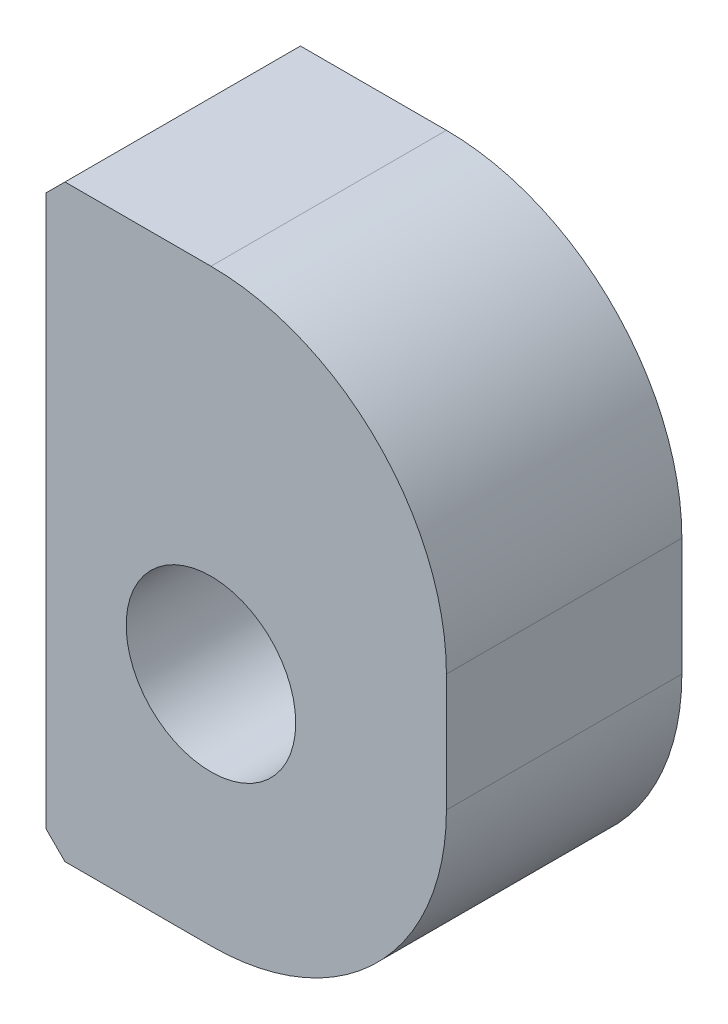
from build123d import *

# Parameters (mm, degrees)
SKETCH1_W           = 8.5
SKETCH1_H           = 12.5
SKETCH1_R           = 1.8
BOSS_EXTRUDE1_DEPTH = 5
SKETCH2_R           = 1.75
CUT_EXTRUDE1_DEPTH  = 1
FILLET1_R           = 5
CHAMFER1_SIZE       = 0.4


with BuildPart() as part:
    # Sketch1 → Boss-Extrude1 (new body)
    with BuildSketch(Plane.XY):
        with Locations((25.75, -30.25)):
            Rectangle(SKETCH1_W, SKETCH1_H)
        with Locations((25, -31.5)):
            Circle(SKETCH1_R, mode=Mode.SUBTRACT)
    extrude(amount=BOSS_EXTRUDE1_DEPTH)

    # Sketch2 → Cut-Extrude1 (cut)
    with BuildSketch(Plane.ZY.offset(-21.5)):
        with Locations((2.381249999, -29.904062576)):
            Circle(SKETCH2_R)
    extrude(amount=-CUT_EXTRUDE1_DEPTH, mode=Mode.SUBTRACT)

    # Fillet1
    fillet1_edges = [part.edges().sort_by_distance(p)[0] for p in [
        (30, -24, 2.5),
        (30, -36.5, 2.5),
    ]]
    fillet(fillet1_edges, radius=FILLET1_R)

    # Chamfer1
    chamfer1_edges = [part.edges().sort_by_distance(p)[0] for p in [
        (21.5, -24, 2.5),
        (21.5, -36.5, 2.5),
        (21.5, -29.904062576, 0.631249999),
    ]]
    chamfer(chamfer1_edges, length=CHAMFER1_SIZE)


solid = part.part
